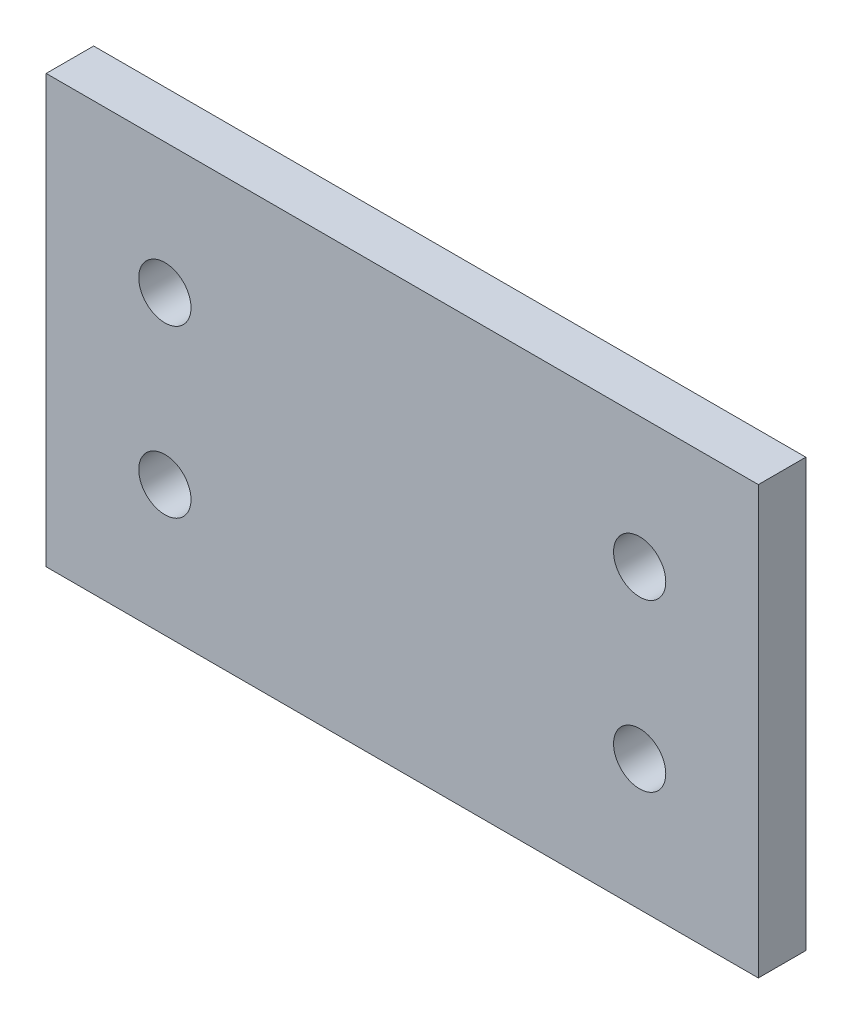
ISO-10303-21;
HEADER;
FILE_DESCRIPTION(('STEP AP214'),'2;1');
FILE_NAME('part.step','',(''),(''),'','','');
FILE_SCHEMA(('AUTOMOTIVE_DESIGN { 1 0 10303 214 1 1 1 1 }'));
ENDSEC;
DATA;
#1=APPLICATION_CONTEXT('core data for automotive mechanical design processes');
#2=APPLICATION_PROTOCOL_DEFINITION('international standard','automotive_design',2000,#1);
#3=PRODUCT_CONTEXT('',#1,'mechanical');
#4=PRODUCT('Part','Part','',(#3));
#5=PRODUCT_RELATED_PRODUCT_CATEGORY('part','',(#4));
#6=PRODUCT_DEFINITION_FORMATION('','',#4);
#7=PRODUCT_DEFINITION_CONTEXT('part definition',#1,'design');
#8=PRODUCT_DEFINITION('design','',#6,#7);
#9=PRODUCT_DEFINITION_SHAPE('','',#8);
#10=(LENGTH_UNIT() NAMED_UNIT(*) SI_UNIT(.MILLI.,.METRE.));
#11=(NAMED_UNIT(*) PLANE_ANGLE_UNIT() SI_UNIT($,.RADIAN.));
#12=(NAMED_UNIT(*) SI_UNIT($,.STERADIAN.) SOLID_ANGLE_UNIT());
#13=UNCERTAINTY_MEASURE_WITH_UNIT(LENGTH_MEASURE(1.E-05),#10,'distance_accuracy_value','');
#14=(GEOMETRIC_REPRESENTATION_CONTEXT(3) GLOBAL_UNCERTAINTY_ASSIGNED_CONTEXT((#13)) GLOBAL_UNIT_ASSIGNED_CONTEXT((#10,
#11,#12)) REPRESENTATION_CONTEXT('',''));
#15=CARTESIAN_POINT('',(0.,0.,0.));
#16=DIRECTION('',(0.,0.,1.));
#17=DIRECTION('',(1.,0.,0.));
#18=AXIS2_PLACEMENT_3D('',#15,#16,#17);
#19=CARTESIAN_POINT('',(0.,0.,20.));
#20=DIRECTION('',(0.,0.,1.));
#21=DIRECTION('',(1.,0.,0.));
#22=AXIS2_PLACEMENT_3D('',#19,#20,#21);
#23=PLANE('',#22);
#24=CARTESIAN_POINT('',(100.,35.,20.));
#25=DIRECTION('',(0.,0.,1.));
#26=DIRECTION('',(1.,0.,0.));
#27=AXIS2_PLACEMENT_3D('',#24,#25,#26);
#28=CIRCLE('',#27,11.);
#29=CARTESIAN_POINT('',(111.,35.,20.));
#30=VERTEX_POINT('',#29);
#31=EDGE_CURVE('E25',#30,#30,#28,.T.);
#32=ORIENTED_EDGE('',*,*,#31,.F.);
#33=EDGE_LOOP('',(#32));
#34=FACE_BOUND('',#33,.T.);
#35=CARTESIAN_POINT('',(100.,-35.,20.));
#36=DIRECTION('',(0.,0.,1.));
#37=DIRECTION('',(1.,0.,0.));
#38=AXIS2_PLACEMENT_3D('',#35,#36,#37);
#39=CIRCLE('',#38,11.);
#40=CARTESIAN_POINT('',(111.,-35.,20.));
#41=VERTEX_POINT('',#40);
#42=EDGE_CURVE('E176',#41,#41,#39,.T.);
#43=ORIENTED_EDGE('',*,*,#42,.F.);
#44=EDGE_LOOP('',(#43));
#45=FACE_BOUND('',#44,.T.);
#46=CARTESIAN_POINT('',(-100.,35.,20.));
#47=DIRECTION('',(0.,0.,1.));
#48=DIRECTION('',(1.,0.,0.));
#49=AXIS2_PLACEMENT_3D('',#46,#47,#48);
#50=CIRCLE('',#49,11.);
#51=CARTESIAN_POINT('',(-89.,35.,20.));
#52=VERTEX_POINT('',#51);
#53=EDGE_CURVE('E73',#52,#52,#50,.T.);
#54=ORIENTED_EDGE('',*,*,#53,.F.);
#55=EDGE_LOOP('',(#54));
#56=FACE_BOUND('',#55,.T.);
#57=CARTESIAN_POINT('',(-100.,-35.,20.));
#58=DIRECTION('',(0.,0.,1.));
#59=DIRECTION('',(1.,0.,0.));
#60=AXIS2_PLACEMENT_3D('',#57,#58,#59);
#61=CIRCLE('',#60,11.);
#62=CARTESIAN_POINT('',(-89.,-35.,20.));
#63=VERTEX_POINT('',#62);
#64=EDGE_CURVE('E161',#63,#63,#61,.T.);
#65=ORIENTED_EDGE('',*,*,#64,.F.);
#66=EDGE_LOOP('',(#65));
#67=FACE_BOUND('',#66,.T.);
#68=DIRECTION('',(1.,0.,0.));
#69=VECTOR('',#68,1.);
#70=CARTESIAN_POINT('',(-150.,-90.,20.));
#71=LINE('',#70,#69);
#72=CARTESIAN_POINT('',(-150.,-90.,20.));
#73=VERTEX_POINT('',#72);
#74=CARTESIAN_POINT('',(150.,-90.,20.));
#75=VERTEX_POINT('',#74);
#76=EDGE_CURVE('E126',#73,#75,#71,.T.);
#77=ORIENTED_EDGE('',*,*,#76,.T.);
#78=DIRECTION('',(0.,1.,0.));
#79=VECTOR('',#78,1.);
#80=CARTESIAN_POINT('',(150.,-90.,20.));
#81=LINE('',#80,#79);
#82=CARTESIAN_POINT('',(150.,90.,20.));
#83=VERTEX_POINT('',#82);
#84=EDGE_CURVE('E142',#75,#83,#81,.T.);
#85=ORIENTED_EDGE('',*,*,#84,.T.);
#86=DIRECTION('',(-1.,0.,0.));
#87=VECTOR('',#86,1.);
#88=CARTESIAN_POINT('',(150.,90.,20.));
#89=LINE('',#88,#87);
#90=CARTESIAN_POINT('',(-150.,90.,20.));
#91=VERTEX_POINT('',#90);
#92=EDGE_CURVE('E118',#83,#91,#89,.T.);
#93=ORIENTED_EDGE('',*,*,#92,.T.);
#94=DIRECTION('',(0.,-1.,0.));
#95=VECTOR('',#94,1.);
#96=CARTESIAN_POINT('',(-150.,90.,20.));
#97=LINE('',#96,#95);
#98=EDGE_CURVE('E117',#91,#73,#97,.T.);
#99=ORIENTED_EDGE('',*,*,#98,.T.);
#100=EDGE_LOOP('',(#77,#85,#93,#99));
#101=FACE_BOUND('',#100,.T.);
#102=ADVANCED_FACE('F16',(#34,#45,#56,#67,#101),#23,.T.);
#103=CARTESIAN_POINT('',(0.,0.,0.));
#104=DIRECTION('',(0.,0.,1.));
#105=DIRECTION('',(1.,0.,0.));
#106=AXIS2_PLACEMENT_3D('',#103,#104,#105);
#107=PLANE('',#106);
#108=CARTESIAN_POINT('',(100.,35.,0.));
#109=DIRECTION('',(0.,0.,1.));
#110=DIRECTION('',(1.,0.,0.));
#111=AXIS2_PLACEMENT_3D('',#108,#109,#110);
#112=CIRCLE('',#111,11.);
#113=CARTESIAN_POINT('',(111.,35.,0.));
#114=VERTEX_POINT('',#113);
#115=EDGE_CURVE('E10',#114,#114,#112,.T.);
#116=ORIENTED_EDGE('',*,*,#115,.T.);
#117=EDGE_LOOP('',(#116));
#118=FACE_BOUND('',#117,.T.);
#119=CARTESIAN_POINT('',(100.,-35.,0.));
#120=DIRECTION('',(0.,0.,1.));
#121=DIRECTION('',(1.,0.,0.));
#122=AXIS2_PLACEMENT_3D('',#119,#120,#121);
#123=CIRCLE('',#122,11.);
#124=CARTESIAN_POINT('',(111.,-35.,0.));
#125=VERTEX_POINT('',#124);
#126=EDGE_CURVE('E61',#125,#125,#123,.T.);
#127=ORIENTED_EDGE('',*,*,#126,.T.);
#128=EDGE_LOOP('',(#127));
#129=FACE_BOUND('',#128,.T.);
#130=CARTESIAN_POINT('',(-100.,35.,0.));
#131=DIRECTION('',(0.,0.,1.));
#132=DIRECTION('',(1.,0.,0.));
#133=AXIS2_PLACEMENT_3D('',#130,#131,#132);
#134=CIRCLE('',#133,11.);
#135=CARTESIAN_POINT('',(-89.,35.,0.));
#136=VERTEX_POINT('',#135);
#137=EDGE_CURVE('E183',#136,#136,#134,.T.);
#138=ORIENTED_EDGE('',*,*,#137,.T.);
#139=EDGE_LOOP('',(#138));
#140=FACE_BOUND('',#139,.T.);
#141=CARTESIAN_POINT('',(-100.,-35.,0.));
#142=DIRECTION('',(0.,0.,1.));
#143=DIRECTION('',(1.,0.,0.));
#144=AXIS2_PLACEMENT_3D('',#141,#142,#143);
#145=CIRCLE('',#144,11.);
#146=CARTESIAN_POINT('',(-89.,-35.,0.));
#147=VERTEX_POINT('',#146);
#148=EDGE_CURVE('E170',#147,#147,#145,.T.);
#149=ORIENTED_EDGE('',*,*,#148,.T.);
#150=EDGE_LOOP('',(#149));
#151=FACE_BOUND('',#150,.T.);
#152=DIRECTION('',(0.,-1.,0.));
#153=VECTOR('',#152,1.);
#154=CARTESIAN_POINT('',(-150.,90.,0.));
#155=LINE('',#154,#153);
#156=CARTESIAN_POINT('',(-150.,90.,0.));
#157=VERTEX_POINT('',#156);
#158=CARTESIAN_POINT('',(-150.,-90.,0.));
#159=VERTEX_POINT('',#158);
#160=EDGE_CURVE('E106',#157,#159,#155,.T.);
#161=ORIENTED_EDGE('',*,*,#160,.F.);
#162=DIRECTION('',(-1.,0.,0.));
#163=VECTOR('',#162,1.);
#164=CARTESIAN_POINT('',(150.,90.,0.));
#165=LINE('',#164,#163);
#166=CARTESIAN_POINT('',(150.,90.,0.));
#167=VERTEX_POINT('',#166);
#168=EDGE_CURVE('E146',#167,#157,#165,.T.);
#169=ORIENTED_EDGE('',*,*,#168,.F.);
#170=DIRECTION('',(0.,1.,0.));
#171=VECTOR('',#170,1.);
#172=CARTESIAN_POINT('',(150.,-90.,0.));
#173=LINE('',#172,#171);
#174=CARTESIAN_POINT('',(150.,-90.,0.));
#175=VERTEX_POINT('',#174);
#176=EDGE_CURVE('E128',#175,#167,#173,.T.);
#177=ORIENTED_EDGE('',*,*,#176,.F.);
#178=DIRECTION('',(1.,0.,0.));
#179=VECTOR('',#178,1.);
#180=CARTESIAN_POINT('',(-150.,-90.,0.));
#181=LINE('',#180,#179);
#182=EDGE_CURVE('E124',#159,#175,#181,.T.);
#183=ORIENTED_EDGE('',*,*,#182,.F.);
#184=EDGE_LOOP('',(#161,#169,#177,#183));
#185=FACE_BOUND('',#184,.T.);
#186=ADVANCED_FACE('F130',(#118,#129,#140,#151,#185),#107,.F.);
#187=CARTESIAN_POINT('',(100.,35.,0.));
#188=DIRECTION('',(0.,0.,-1.));
#189=DIRECTION('',(1.,0.,0.));
#190=AXIS2_PLACEMENT_3D('',#187,#188,#189);
#191=CYLINDRICAL_SURFACE('',#190,11.);
#192=DIRECTION('',(0.,0.,1.));
#193=VECTOR('',#192,1.);
#194=CARTESIAN_POINT('',(111.,35.,0.));
#195=LINE('',#194,#193);
#196=EDGE_CURVE('E175',#114,#30,#195,.T.);
#197=ORIENTED_EDGE('',*,*,#196,.T.);
#198=ORIENTED_EDGE('',*,*,#31,.T.);
#199=ORIENTED_EDGE('',*,*,#196,.F.);
#200=ORIENTED_EDGE('',*,*,#115,.F.);
#201=EDGE_LOOP('',(#197,#198,#199,#200));
#202=FACE_BOUND('',#201,.T.);
#203=ADVANCED_FACE('F253',(#202),#191,.F.);
#204=CARTESIAN_POINT('',(100.,-35.,0.));
#205=DIRECTION('',(0.,0.,-1.));
#206=DIRECTION('',(1.,0.,0.));
#207=AXIS2_PLACEMENT_3D('',#204,#205,#206);
#208=CYLINDRICAL_SURFACE('',#207,11.);
#209=DIRECTION('',(0.,0.,1.));
#210=VECTOR('',#209,1.);
#211=CARTESIAN_POINT('',(111.,-35.,0.));
#212=LINE('',#211,#210);
#213=EDGE_CURVE('E186',#125,#41,#212,.T.);
#214=ORIENTED_EDGE('',*,*,#213,.T.);
#215=ORIENTED_EDGE('',*,*,#42,.T.);
#216=ORIENTED_EDGE('',*,*,#213,.F.);
#217=ORIENTED_EDGE('',*,*,#126,.F.);
#218=EDGE_LOOP('',(#214,#215,#216,#217));
#219=FACE_BOUND('',#218,.T.);
#220=ADVANCED_FACE('F245',(#219),#208,.F.);
#221=CARTESIAN_POINT('',(-100.,35.,0.));
#222=DIRECTION('',(0.,0.,-1.));
#223=DIRECTION('',(1.,0.,0.));
#224=AXIS2_PLACEMENT_3D('',#221,#222,#223);
#225=CYLINDRICAL_SURFACE('',#224,11.);
#226=DIRECTION('',(0.,0.,1.));
#227=VECTOR('',#226,1.);
#228=CARTESIAN_POINT('',(-89.,35.,0.));
#229=LINE('',#228,#227);
#230=EDGE_CURVE('E167',#136,#52,#229,.T.);
#231=ORIENTED_EDGE('',*,*,#230,.T.);
#232=ORIENTED_EDGE('',*,*,#53,.T.);
#233=ORIENTED_EDGE('',*,*,#230,.F.);
#234=ORIENTED_EDGE('',*,*,#137,.F.);
#235=EDGE_LOOP('',(#231,#232,#233,#234));
#236=FACE_BOUND('',#235,.T.);
#237=ADVANCED_FACE('F236',(#236),#225,.F.);
#238=CARTESIAN_POINT('',(-100.,-35.,0.));
#239=DIRECTION('',(0.,0.,-1.));
#240=DIRECTION('',(1.,0.,0.));
#241=AXIS2_PLACEMENT_3D('',#238,#239,#240);
#242=CYLINDRICAL_SURFACE('',#241,11.);
#243=DIRECTION('',(0.,0.,1.));
#244=VECTOR('',#243,1.);
#245=CARTESIAN_POINT('',(-89.,-35.,0.));
#246=LINE('',#245,#244);
#247=EDGE_CURVE('E157',#147,#63,#246,.T.);
#248=ORIENTED_EDGE('',*,*,#247,.T.);
#249=ORIENTED_EDGE('',*,*,#64,.T.);
#250=ORIENTED_EDGE('',*,*,#247,.F.);
#251=ORIENTED_EDGE('',*,*,#148,.F.);
#252=EDGE_LOOP('',(#248,#249,#250,#251));
#253=FACE_BOUND('',#252,.T.);
#254=ADVANCED_FACE('F228',(#253),#242,.F.);
#255=CARTESIAN_POINT('',(-150.,90.,0.));
#256=DIRECTION('',(1.,0.,0.));
#257=DIRECTION('',(0.,1.,0.));
#258=AXIS2_PLACEMENT_3D('',#255,#256,#257);
#259=PLANE('',#258);
#260=ORIENTED_EDGE('',*,*,#160,.T.);
#261=DIRECTION('',(0.,0.,1.));
#262=VECTOR('',#261,1.);
#263=CARTESIAN_POINT('',(-150.,-90.,0.));
#264=LINE('',#263,#262);
#265=EDGE_CURVE('E109',#159,#73,#264,.T.);
#266=ORIENTED_EDGE('',*,*,#265,.T.);
#267=ORIENTED_EDGE('',*,*,#98,.F.);
#268=DIRECTION('',(0.,0.,1.));
#269=VECTOR('',#268,1.);
#270=CARTESIAN_POINT('',(-150.,90.,0.));
#271=LINE('',#270,#269);
#272=EDGE_CURVE('E112',#157,#91,#271,.T.);
#273=ORIENTED_EDGE('',*,*,#272,.F.);
#274=EDGE_LOOP('',(#260,#266,#267,#273));
#275=FACE_BOUND('',#274,.T.);
#276=ADVANCED_FACE('F108',(#275),#259,.F.);
#277=CARTESIAN_POINT('',(150.,90.,0.));
#278=DIRECTION('',(0.,-1.,0.));
#279=DIRECTION('',(0.,0.,-1.));
#280=AXIS2_PLACEMENT_3D('',#277,#278,#279);
#281=PLANE('',#280);
#282=ORIENTED_EDGE('',*,*,#168,.T.);
#283=ORIENTED_EDGE('',*,*,#272,.T.);
#284=ORIENTED_EDGE('',*,*,#92,.F.);
#285=DIRECTION('',(0.,0.,1.));
#286=VECTOR('',#285,1.);
#287=CARTESIAN_POINT('',(150.,90.,0.));
#288=LINE('',#287,#286);
#289=EDGE_CURVE('E147',#167,#83,#288,.T.);
#290=ORIENTED_EDGE('',*,*,#289,.F.);
#291=EDGE_LOOP('',(#282,#283,#284,#290));
#292=FACE_BOUND('',#291,.T.);
#293=ADVANCED_FACE('F211',(#292),#281,.F.);
#294=CARTESIAN_POINT('',(150.,-90.,0.));
#295=DIRECTION('',(-1.,0.,0.));
#296=DIRECTION('',(0.,0.,1.));
#297=AXIS2_PLACEMENT_3D('',#294,#295,#296);
#298=PLANE('',#297);
#299=ORIENTED_EDGE('',*,*,#176,.T.);
#300=ORIENTED_EDGE('',*,*,#289,.T.);
#301=ORIENTED_EDGE('',*,*,#84,.F.);
#302=DIRECTION('',(0.,0.,1.));
#303=VECTOR('',#302,1.);
#304=CARTESIAN_POINT('',(150.,-90.,0.));
#305=LINE('',#304,#303);
#306=EDGE_CURVE('E134',#175,#75,#305,.T.);
#307=ORIENTED_EDGE('',*,*,#306,.F.);
#308=EDGE_LOOP('',(#299,#300,#301,#307));
#309=FACE_BOUND('',#308,.T.);
#310=ADVANCED_FACE('F202',(#309),#298,.F.);
#311=CARTESIAN_POINT('',(-150.,-90.,0.));
#312=DIRECTION('',(0.,1.,0.));
#313=DIRECTION('',(1.,0.,0.));
#314=AXIS2_PLACEMENT_3D('',#311,#312,#313);
#315=PLANE('',#314);
#316=ORIENTED_EDGE('',*,*,#182,.T.);
#317=ORIENTED_EDGE('',*,*,#306,.T.);
#318=ORIENTED_EDGE('',*,*,#76,.F.);
#319=ORIENTED_EDGE('',*,*,#265,.F.);
#320=EDGE_LOOP('',(#316,#317,#318,#319));
#321=FACE_BOUND('',#320,.T.);
#322=ADVANCED_FACE('F122',(#321),#315,.F.);
#323=CLOSED_SHELL('',(#102,#186,#203,#220,#237,#254,#276,#293,#310,#322));
#324=MANIFOLD_SOLID_BREP('B1',#323);
#325=ADVANCED_BREP_SHAPE_REPRESENTATION('',(#18,#324),#14);
#326=SHAPE_DEFINITION_REPRESENTATION(#9,#325);
ENDSEC;
END-ISO-10303-21;
